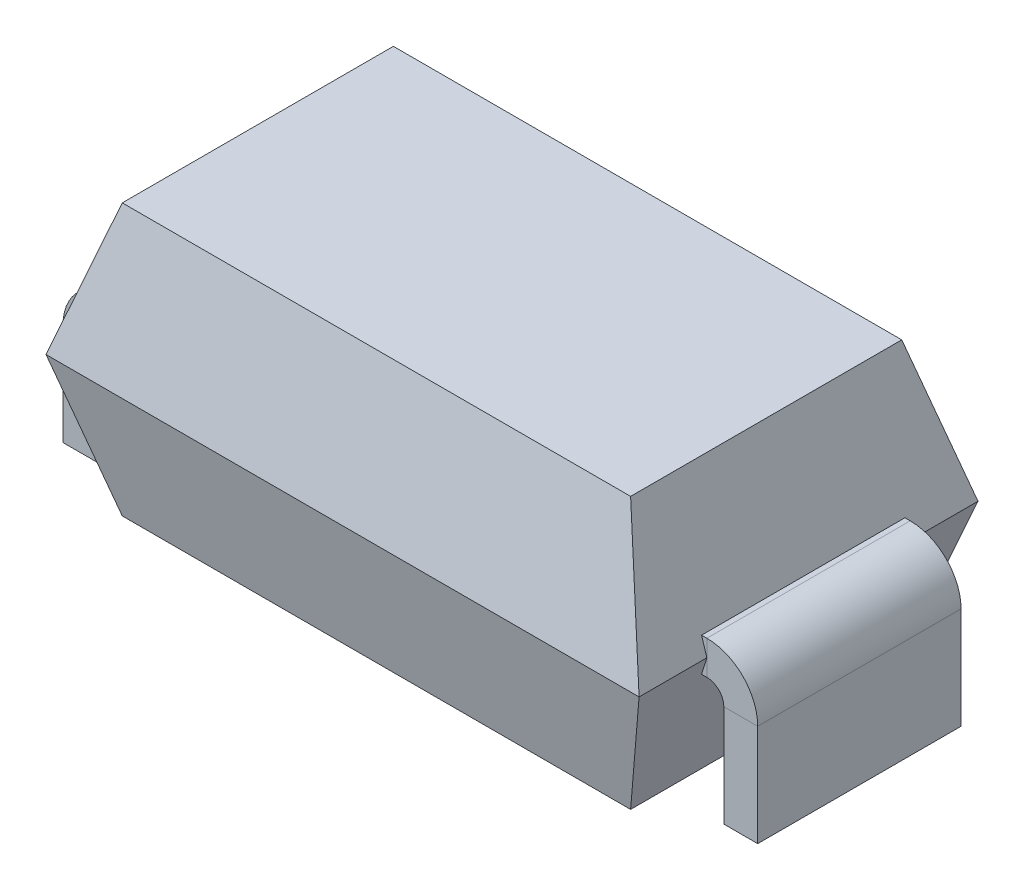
from build123d import *

# Parameters (mm, degrees)
SKETCH4_W = 1.2
SKETCH4_H = 0.2


with BuildPart() as part:
    # Base → Loft1 section 0
    with BuildSketch(Plane(origin=(0, 0, 0), x_dir=(1, 0, 0), z_dir=(0, 1, 0))):
        with BuildLine():
            Line((-1.75, 1), (1.75, 1))
            Line((1.75, 1), (1.75, -1))
            Line((1.75, -1), (-1.75, -1))
            Line((-1.75, -1), (-1.75, 1))
        make_face()
    # Top → Loft1 section 1
    with BuildSketch(Plane(origin=(0, 0.8, 0), x_dir=(1, 0, 0), z_dir=(0, 1, 0))):
        with BuildLine():
            Line((-1.5, 0.8), (1.5, 0.8))
            Line((1.5, 0.8), (1.5, -0.8))
            Line((1.5, -0.8), (-1.5, -0.8))
            Line((-1.5, -0.8), (-1.5, 0.8))
        make_face()
    loft1 = loft()

    # Mirror1: Loft1 across plane
    add(loft1.mirror(Plane.ZX))

    # Sweep1: sweep along a path in Sketch3
    with BuildLine(Plane.XY) as sweep1_path:
        Line((1.55, 0), (1.75, 0))
        ThreePointArc((1.75, 0), (1.891421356, -0.058578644), (1.95, -0.2))
        Line((1.95, -0.2), (1.95, -0.8))
    # Sketch4 → Sweep1 (sweep)
    with BuildSketch(Plane(origin=(1.55, 0, 0), x_dir=(0, 0, -1), z_dir=(1, 0, 0))):
        Rectangle(SKETCH4_W, SKETCH4_H)
    sweep1 = sweep(path=sweep1_path.line)

    # Mirror3: Sweep1 across plane
    add(sweep1.mirror(Plane(origin=(0, 0, 0), x_dir=(0, 0, 1), z_dir=(1, 0, 0))))


solid = part.part
